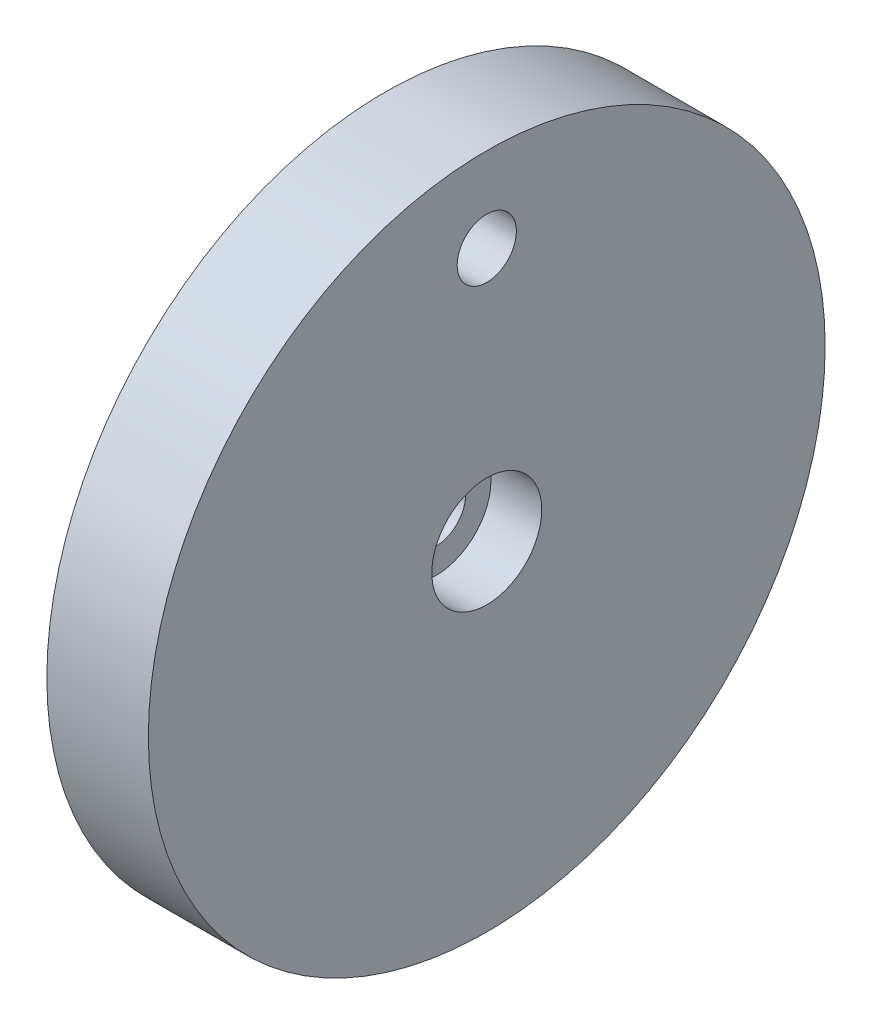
from build123d import *

# Parameters (mm, degrees)
SKETCH1_R      = 20
SKETCH1_R_2    = 1.75
EXTRUDE1_DEPTH = 6
SKETCH2_R      = 3.25
EXTRUDE2_DEPTH = 3
SKETCH3_R      = 3.25
EXTRUDE3_DEPTH = 3


with BuildPart() as part:
    # Sketch1 → Extrude1 (new body)
    with BuildSketch(Plane(origin=(0, 0, 0), x_dir=(0, 0, -1), z_dir=(1, 0, 0))):
        Circle(SKETCH1_R)
        Circle(SKETCH1_R_2, mode=Mode.SUBTRACT)
        with Locations((0, 15)):
            Circle(SKETCH1_R_2, mode=Mode.SUBTRACT)
    extrude(amount=EXTRUDE1_DEPTH)

    # Sketch2 → Extrude2 (cut)
    with BuildSketch(Plane.ZY):
        with Locations((0, 15)):
            Circle(SKETCH2_R)
    extrude(amount=-EXTRUDE2_DEPTH, mode=Mode.SUBTRACT)

    # Sketch3 → Extrude3 (cut)
    with BuildSketch(Plane(origin=(6, 0, 0), x_dir=(0, 0, -1), z_dir=(1, 0, 0))):
        Circle(SKETCH3_R)
    extrude(amount=-EXTRUDE3_DEPTH, mode=Mode.SUBTRACT)


solid = part.part
